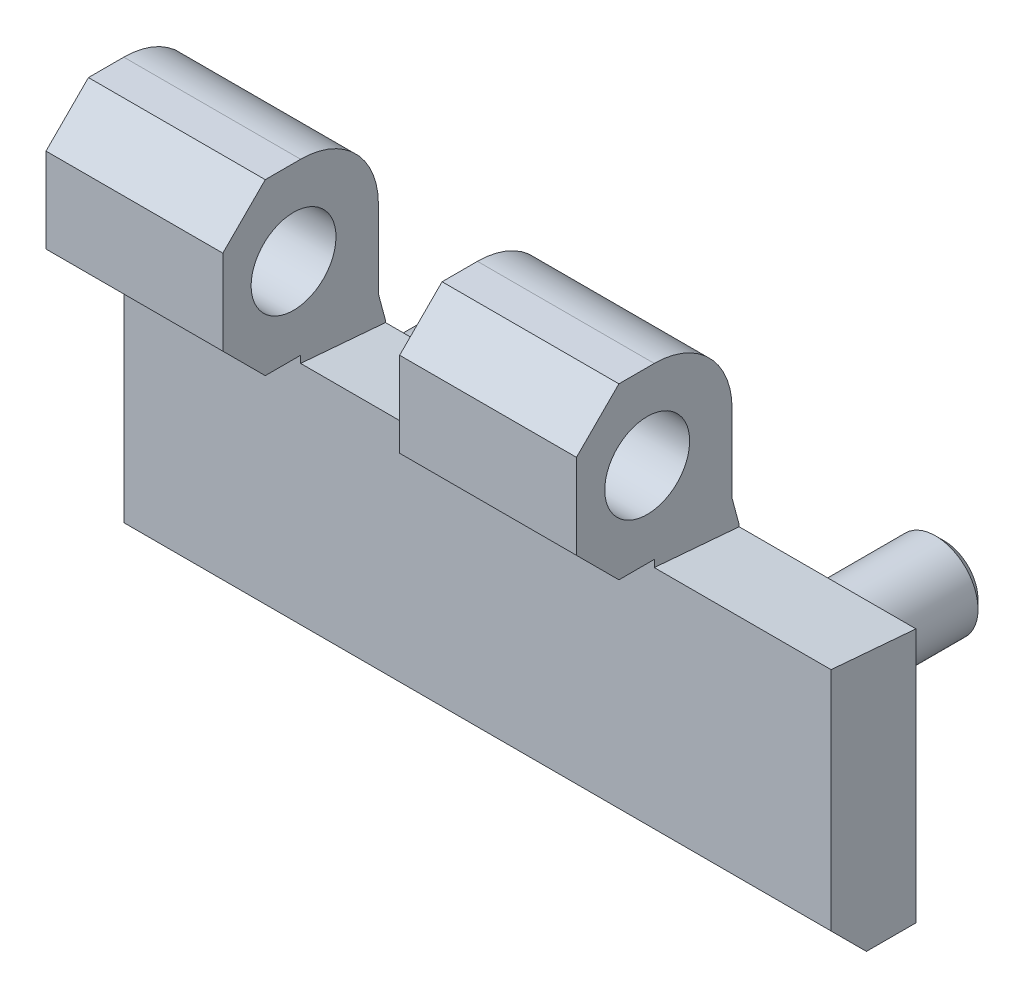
ISO-10303-21;
HEADER;
FILE_DESCRIPTION(('STEP AP214'),'2;1');
FILE_NAME('part.step','',(''),(''),'','','');
FILE_SCHEMA(('AUTOMOTIVE_DESIGN { 1 0 10303 214 1 1 1 1 }'));
ENDSEC;
DATA;
#1=APPLICATION_CONTEXT('core data for automotive mechanical design processes');
#2=APPLICATION_PROTOCOL_DEFINITION('international standard','automotive_design',2000,#1);
#3=PRODUCT_CONTEXT('',#1,'mechanical');
#4=PRODUCT('Part','Part','',(#3));
#5=PRODUCT_RELATED_PRODUCT_CATEGORY('part','',(#4));
#6=PRODUCT_DEFINITION_FORMATION('','',#4);
#7=PRODUCT_DEFINITION_CONTEXT('part definition',#1,'design');
#8=PRODUCT_DEFINITION('design','',#6,#7);
#9=PRODUCT_DEFINITION_SHAPE('','',#8);
#10=(LENGTH_UNIT() NAMED_UNIT(*) SI_UNIT(.MILLI.,.METRE.));
#11=(NAMED_UNIT(*) PLANE_ANGLE_UNIT() SI_UNIT($,.RADIAN.));
#12=(NAMED_UNIT(*) SI_UNIT($,.STERADIAN.) SOLID_ANGLE_UNIT());
#13=UNCERTAINTY_MEASURE_WITH_UNIT(LENGTH_MEASURE(1.E-05),#10,'distance_accuracy_value','');
#14=(GEOMETRIC_REPRESENTATION_CONTEXT(3) GLOBAL_UNCERTAINTY_ASSIGNED_CONTEXT((#13)) GLOBAL_UNIT_ASSIGNED_CONTEXT((#10,
#11,#12)) REPRESENTATION_CONTEXT('',''));
#15=CARTESIAN_POINT('',(0.,0.,0.));
#16=DIRECTION('',(0.,0.,1.));
#17=DIRECTION('',(1.,0.,0.));
#18=AXIS2_PLACEMENT_3D('',#15,#16,#17);
#19=CARTESIAN_POINT('',(-10.,8.,0.));
#20=DIRECTION('',(0.,0.99654575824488,-0.0830454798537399));
#21=DIRECTION('',(0.,0.0830454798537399,0.99654575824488));
#22=AXIS2_PLACEMENT_3D('',#19,#20,#21);
#23=PLANE('',#22);
#24=DIRECTION('',(0.,-0.0830454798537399,-0.99654575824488));
#25=VECTOR('',#24,1.);
#26=CARTESIAN_POINT('',(2.5,8.,0.));
#27=LINE('',#26,#25);
#28=CARTESIAN_POINT('',(2.5,8.5,6.));
#29=VERTEX_POINT('',#28);
#30=CARTESIAN_POINT('',(2.5,8.,0.));
#31=VERTEX_POINT('',#30);
#32=EDGE_CURVE('E29',#29,#31,#27,.T.);
#33=ORIENTED_EDGE('',*,*,#32,.F.);
#34=DIRECTION('',(1.,0.,0.));
#35=VECTOR('',#34,1.);
#36=CARTESIAN_POINT('',(-10.,8.5,6.));
#37=LINE('',#36,#35);
#38=CARTESIAN_POINT('',(15.,8.5,6.));
#39=VERTEX_POINT('',#38);
#40=EDGE_CURVE('E403',#29,#39,#37,.T.);
#41=ORIENTED_EDGE('',*,*,#40,.T.);
#42=DIRECTION('',(0.,-0.0830454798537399,-0.99654575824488));
#43=VECTOR('',#42,1.);
#44=CARTESIAN_POINT('',(15.,8.,0.));
#45=LINE('',#44,#43);
#46=CARTESIAN_POINT('',(15.,8.,0.));
#47=VERTEX_POINT('',#46);
#48=EDGE_CURVE('E369',#39,#47,#45,.T.);
#49=ORIENTED_EDGE('',*,*,#48,.T.);
#50=DIRECTION('',(1.,0.,0.));
#51=VECTOR('',#50,1.);
#52=CARTESIAN_POINT('',(-10.,8.,0.));
#53=LINE('',#52,#51);
#54=EDGE_CURVE('E36',#31,#47,#53,.T.);
#55=ORIENTED_EDGE('',*,*,#54,.F.);
#56=EDGE_LOOP('',(#33,#41,#49,#55));
#57=FACE_BOUND('',#56,.T.);
#58=ADVANCED_FACE('F14',(#57),#23,.T.);
#59=CARTESIAN_POINT('',(-10.,-10.,3.5));
#60=DIRECTION('',(0.,-1.,0.));
#61=DIRECTION('',(1.,0.,0.));
#62=AXIS2_PLACEMENT_3D('',#59,#60,#61);
#63=PLANE('',#62);
#64=DIRECTION('',(1.,0.,0.));
#65=VECTOR('',#64,1.);
#66=CARTESIAN_POINT('',(-10.,-10.,0.));
#67=LINE('',#66,#65);
#68=CARTESIAN_POINT('',(-10.,-10.,0.));
#69=VERTEX_POINT('',#68);
#70=CARTESIAN_POINT('',(40.,-10.,0.));
#71=VERTEX_POINT('',#70);
#72=EDGE_CURVE('E407',#69,#71,#67,.T.);
#73=ORIENTED_EDGE('',*,*,#72,.T.);
#74=DIRECTION('',(0.,0.,-1.));
#75=VECTOR('',#74,1.);
#76=CARTESIAN_POINT('',(40.,-10.,3.5));
#77=LINE('',#76,#75);
#78=CARTESIAN_POINT('',(40.,-10.,3.5));
#79=VERTEX_POINT('',#78);
#80=EDGE_CURVE('E374',#79,#71,#77,.T.);
#81=ORIENTED_EDGE('',*,*,#80,.F.);
#82=DIRECTION('',(1.,0.,0.));
#83=VECTOR('',#82,1.);
#84=CARTESIAN_POINT('',(-10.,-10.,3.5));
#85=LINE('',#84,#83);
#86=CARTESIAN_POINT('',(-10.,-10.,3.5));
#87=VERTEX_POINT('',#86);
#88=EDGE_CURVE('E396',#87,#79,#85,.T.);
#89=ORIENTED_EDGE('',*,*,#88,.F.);
#90=DIRECTION('',(0.,0.,-1.));
#91=VECTOR('',#90,1.);
#92=CARTESIAN_POINT('',(-10.,-10.,3.5));
#93=LINE('',#92,#91);
#94=EDGE_CURVE('E387',#87,#69,#93,.T.);
#95=ORIENTED_EDGE('',*,*,#94,.T.);
#96=EDGE_LOOP('',(#73,#81,#89,#95));
#97=FACE_BOUND('',#96,.T.);
#98=ADVANCED_FACE('F16',(#97),#63,.T.);
#99=CARTESIAN_POINT('',(-10.,-10.,0.));
#100=DIRECTION('',(0.,0.,-1.));
#101=DIRECTION('',(-1.,0.,0.));
#102=AXIS2_PLACEMENT_3D('',#99,#100,#101);
#103=PLANE('',#102);
#104=CARTESIAN_POINT('',(0.,0.,0.));
#105=DIRECTION('',(0.,0.,-1.));
#106=DIRECTION('',(-1.,0.,0.));
#107=AXIS2_PLACEMENT_3D('',#104,#105,#106);
#108=CIRCLE('',#107,3.);
#109=CARTESIAN_POINT('',(-3.,0.,0.));
#110=VERTEX_POINT('',#109);
#111=EDGE_CURVE('E9',#110,#110,#108,.T.);
#112=ORIENTED_EDGE('',*,*,#111,.F.);
#113=EDGE_LOOP('',(#112));
#114=FACE_BOUND('',#113,.T.);
#115=CARTESIAN_POINT('',(30.,0.,0.));
#116=DIRECTION('',(0.,0.,-1.));
#117=DIRECTION('',(-1.,0.,0.));
#118=AXIS2_PLACEMENT_3D('',#115,#116,#117);
#119=CIRCLE('',#118,3.);
#120=CARTESIAN_POINT('',(27.,0.,0.));
#121=VERTEX_POINT('',#120);
#122=EDGE_CURVE('E22',#121,#121,#119,.T.);
#123=ORIENTED_EDGE('',*,*,#122,.F.);
#124=EDGE_LOOP('',(#123));
#125=FACE_BOUND('',#124,.T.);
#126=DIRECTION('',(0.,1.,0.));
#127=VECTOR('',#126,1.);
#128=CARTESIAN_POINT('',(-10.,-10.,0.));
#129=LINE('',#128,#127);
#130=CARTESIAN_POINT('',(-10.,8.1339745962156,0.));
#131=VERTEX_POINT('',#130);
#132=EDGE_CURVE('E194',#69,#131,#129,.T.);
#133=ORIENTED_EDGE('',*,*,#132,.T.);
#134=DIRECTION('',(1.,0.,0.));
#135=VECTOR('',#134,1.);
#136=CARTESIAN_POINT('',(-10.,8.1339745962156,0.));
#137=LINE('',#136,#135);
#138=CARTESIAN_POINT('',(2.5,8.1339745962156,0.));
#139=VERTEX_POINT('',#138);
#140=EDGE_CURVE('E191',#131,#139,#137,.T.);
#141=ORIENTED_EDGE('',*,*,#140,.T.);
#142=DIRECTION('',(0.,1.,0.));
#143=VECTOR('',#142,1.);
#144=CARTESIAN_POINT('',(2.5,3.,0.));
#145=LINE('',#144,#143);
#146=EDGE_CURVE('E180',#31,#139,#145,.T.);
#147=ORIENTED_EDGE('',*,*,#146,.F.);
#148=ORIENTED_EDGE('',*,*,#54,.T.);
#149=DIRECTION('',(0.,1.,0.));
#150=VECTOR('',#149,1.);
#151=CARTESIAN_POINT('',(15.,3.,0.));
#152=LINE('',#151,#150);
#153=CARTESIAN_POINT('',(15.,8.1339745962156,0.));
#154=VERTEX_POINT('',#153);
#155=EDGE_CURVE('E284',#47,#154,#152,.T.);
#156=ORIENTED_EDGE('',*,*,#155,.T.);
#157=DIRECTION('',(-1.,0.,0.));
#158=VECTOR('',#157,1.);
#159=CARTESIAN_POINT('',(27.5,8.1339745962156,0.));
#160=LINE('',#159,#158);
#161=CARTESIAN_POINT('',(27.5,8.1339745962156,0.));
#162=VERTEX_POINT('',#161);
#163=EDGE_CURVE('E366',#162,#154,#160,.T.);
#164=ORIENTED_EDGE('',*,*,#163,.F.);
#165=DIRECTION('',(0.,1.,0.));
#166=VECTOR('',#165,1.);
#167=CARTESIAN_POINT('',(27.5,3.,0.));
#168=LINE('',#167,#166);
#169=CARTESIAN_POINT('',(27.5,8.,0.));
#170=VERTEX_POINT('',#169);
#171=EDGE_CURVE('E319',#170,#162,#168,.T.);
#172=ORIENTED_EDGE('',*,*,#171,.F.);
#173=CARTESIAN_POINT('',(40.,8.,0.));
#174=VERTEX_POINT('',#173);
#175=EDGE_CURVE('E405',#170,#174,#53,.T.);
#176=ORIENTED_EDGE('',*,*,#175,.T.);
#177=DIRECTION('',(0.,1.,0.));
#178=VECTOR('',#177,1.);
#179=CARTESIAN_POINT('',(40.,-10.,0.));
#180=LINE('',#179,#178);
#181=EDGE_CURVE('E375',#71,#174,#180,.T.);
#182=ORIENTED_EDGE('',*,*,#181,.F.);
#183=ORIENTED_EDGE('',*,*,#72,.F.);
#184=EDGE_LOOP('',(#133,#141,#147,#148,#156,#164,#172,#176,#182,#183));
#185=FACE_BOUND('',#184,.T.);
#186=ADVANCED_FACE('F192',(#114,#125,#185),#103,.T.);
#187=DIRECTION('',(0.,-0.0830454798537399,-0.99654575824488));
#188=VECTOR('',#187,1.);
#189=CARTESIAN_POINT('',(27.5,8.,0.));
#190=LINE('',#189,#188);
#191=CARTESIAN_POINT('',(27.5,8.5,6.));
#192=VERTEX_POINT('',#191);
#193=EDGE_CURVE('E372',#192,#170,#190,.T.);
#194=ORIENTED_EDGE('',*,*,#193,.F.);
#195=CARTESIAN_POINT('',(40.,8.5,6.));
#196=VERTEX_POINT('',#195);
#197=EDGE_CURVE('E402',#192,#196,#37,.T.);
#198=ORIENTED_EDGE('',*,*,#197,.T.);
#199=DIRECTION('',(0.,0.0830454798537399,0.99654575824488));
#200=VECTOR('',#199,1.);
#201=CARTESIAN_POINT('',(40.,8.,0.));
#202=LINE('',#201,#200);
#203=EDGE_CURVE('E378',#174,#196,#202,.T.);
#204=ORIENTED_EDGE('',*,*,#203,.F.);
#205=ORIENTED_EDGE('',*,*,#175,.F.);
#206=EDGE_LOOP('',(#194,#198,#204,#205));
#207=FACE_BOUND('',#206,.T.);
#208=ADVANCED_FACE('F414',(#207),#23,.T.);
#209=CARTESIAN_POINT('',(-10.,8.5,6.));
#210=DIRECTION('',(0.,0.,1.));
#211=DIRECTION('',(1.,0.,0.));
#212=AXIS2_PLACEMENT_3D('',#209,#210,#211);
#213=PLANE('',#212);
#214=DIRECTION('',(0.,-1.,0.));
#215=VECTOR('',#214,1.);
#216=CARTESIAN_POINT('',(-10.,8.5,6.));
#217=LINE('',#216,#215);
#218=CARTESIAN_POINT('',(-10.,9.,6.));
#219=VERTEX_POINT('',#218);
#220=CARTESIAN_POINT('',(-10.,-7.5,6.));
#221=VERTEX_POINT('',#220);
#222=EDGE_CURVE('E391',#219,#221,#217,.T.);
#223=ORIENTED_EDGE('',*,*,#222,.T.);
#224=DIRECTION('',(1.,0.,0.));
#225=VECTOR('',#224,1.);
#226=CARTESIAN_POINT('',(-10.,-7.5,6.));
#227=LINE('',#226,#225);
#228=CARTESIAN_POINT('',(40.,-7.5,6.));
#229=VERTEX_POINT('',#228);
#230=EDGE_CURVE('E400',#221,#229,#227,.T.);
#231=ORIENTED_EDGE('',*,*,#230,.T.);
#232=DIRECTION('',(0.,-1.,0.));
#233=VECTOR('',#232,1.);
#234=CARTESIAN_POINT('',(40.,8.5,6.));
#235=LINE('',#234,#233);
#236=EDGE_CURVE('E381',#196,#229,#235,.T.);
#237=ORIENTED_EDGE('',*,*,#236,.F.);
#238=ORIENTED_EDGE('',*,*,#197,.F.);
#239=DIRECTION('',(0.,-1.,0.));
#240=VECTOR('',#239,1.);
#241=CARTESIAN_POINT('',(27.5,9.,6.));
#242=LINE('',#241,#240);
#243=CARTESIAN_POINT('',(27.5,9.,6.));
#244=VERTEX_POINT('',#243);
#245=EDGE_CURVE('E337',#244,#192,#242,.T.);
#246=ORIENTED_EDGE('',*,*,#245,.F.);
#247=DIRECTION('',(-1.,0.,0.));
#248=VECTOR('',#247,1.);
#249=CARTESIAN_POINT('',(27.5,9.,6.));
#250=LINE('',#249,#248);
#251=CARTESIAN_POINT('',(15.,9.,6.));
#252=VERTEX_POINT('',#251);
#253=EDGE_CURVE('E342',#244,#252,#250,.T.);
#254=ORIENTED_EDGE('',*,*,#253,.T.);
#255=DIRECTION('',(0.,-1.,0.));
#256=VECTOR('',#255,1.);
#257=CARTESIAN_POINT('',(15.,9.,6.));
#258=LINE('',#257,#256);
#259=EDGE_CURVE('E311',#252,#39,#258,.T.);
#260=ORIENTED_EDGE('',*,*,#259,.T.);
#261=ORIENTED_EDGE('',*,*,#40,.F.);
#262=DIRECTION('',(0.,-1.,0.));
#263=VECTOR('',#262,1.);
#264=CARTESIAN_POINT('',(2.5,9.,6.));
#265=LINE('',#264,#263);
#266=CARTESIAN_POINT('',(2.5,9.,6.));
#267=VERTEX_POINT('',#266);
#268=EDGE_CURVE('E235',#267,#29,#265,.T.);
#269=ORIENTED_EDGE('',*,*,#268,.F.);
#270=DIRECTION('',(1.,0.,0.));
#271=VECTOR('',#270,1.);
#272=CARTESIAN_POINT('',(-10.,9.,6.));
#273=LINE('',#272,#271);
#274=EDGE_CURVE('E268',#219,#267,#273,.T.);
#275=ORIENTED_EDGE('',*,*,#274,.F.);
#276=EDGE_LOOP('',(#223,#231,#237,#238,#246,#254,#260,#261,#269,#275));
#277=FACE_BOUND('',#276,.T.);
#278=ADVANCED_FACE('F422',(#277),#213,.T.);
#279=CARTESIAN_POINT('',(-10.,-7.5,6.));
#280=DIRECTION('',(0.,-0.707106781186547,0.707106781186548));
#281=DIRECTION('',(0.,-0.707106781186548,-0.707106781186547));
#282=AXIS2_PLACEMENT_3D('',#279,#280,#281);
#283=PLANE('',#282);
#284=ORIENTED_EDGE('',*,*,#88,.T.);
#285=DIRECTION('',(0.,-0.707106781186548,-0.707106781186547));
#286=VECTOR('',#285,1.);
#287=CARTESIAN_POINT('',(40.,-7.5,6.));
#288=LINE('',#287,#286);
#289=EDGE_CURVE('E384',#229,#79,#288,.T.);
#290=ORIENTED_EDGE('',*,*,#289,.F.);
#291=ORIENTED_EDGE('',*,*,#230,.F.);
#292=DIRECTION('',(0.,-0.707106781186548,-0.707106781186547));
#293=VECTOR('',#292,1.);
#294=CARTESIAN_POINT('',(-10.,-7.5,6.));
#295=LINE('',#294,#293);
#296=EDGE_CURVE('E393',#221,#87,#295,.T.);
#297=ORIENTED_EDGE('',*,*,#296,.T.);
#298=EDGE_LOOP('',(#284,#290,#291,#297));
#299=FACE_BOUND('',#298,.T.);
#300=ADVANCED_FACE('F434',(#299),#283,.T.);
#301=CARTESIAN_POINT('',(-10.,-10.,0.));
#302=DIRECTION('',(1.,0.,0.));
#303=DIRECTION('',(0.,1.,0.));
#304=AXIS2_PLACEMENT_3D('',#301,#302,#303);
#305=PLANE('',#304);
#306=ORIENTED_EDGE('',*,*,#296,.F.);
#307=ORIENTED_EDGE('',*,*,#222,.F.);
#308=DIRECTION('',(0.,0.,-1.));
#309=VECTOR('',#308,1.);
#310=CARTESIAN_POINT('',(-10.,9.,8.5));
#311=LINE('',#310,#309);
#312=CARTESIAN_POINT('',(-10.,9.,8.5));
#313=VERTEX_POINT('',#312);
#314=EDGE_CURVE('E262',#313,#219,#311,.T.);
#315=ORIENTED_EDGE('',*,*,#314,.F.);
#316=DIRECTION('',(0.,-0.707106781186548,-0.707106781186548));
#317=VECTOR('',#316,1.);
#318=CARTESIAN_POINT('',(-10.,12.,11.5));
#319=LINE('',#318,#317);
#320=CARTESIAN_POINT('',(-10.,12.,11.5));
#321=VERTEX_POINT('',#320);
#322=EDGE_CURVE('E259',#321,#313,#319,.T.);
#323=ORIENTED_EDGE('',*,*,#322,.F.);
#324=DIRECTION('',(0.,-1.,0.));
#325=VECTOR('',#324,1.);
#326=CARTESIAN_POINT('',(-10.,18.,11.5));
#327=LINE('',#326,#325);
#328=CARTESIAN_POINT('',(-10.,18.,11.5));
#329=VERTEX_POINT('',#328);
#330=EDGE_CURVE('E256',#329,#321,#327,.T.);
#331=ORIENTED_EDGE('',*,*,#330,.F.);
#332=DIRECTION('',(0.,-0.707106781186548,0.707106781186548));
#333=VECTOR('',#332,1.);
#334=CARTESIAN_POINT('',(-10.,21.,8.5));
#335=LINE('',#334,#333);
#336=CARTESIAN_POINT('',(-10.,21.,8.5));
#337=VERTEX_POINT('',#336);
#338=EDGE_CURVE('E253',#337,#329,#335,.T.);
#339=ORIENTED_EDGE('',*,*,#338,.F.);
#340=DIRECTION('',(0.,0.,1.));
#341=VECTOR('',#340,1.);
#342=CARTESIAN_POINT('',(-10.,21.,6.));
#343=LINE('',#342,#341);
#344=CARTESIAN_POINT('',(-10.,21.,6.));
#345=VERTEX_POINT('',#344);
#346=EDGE_CURVE('E250',#345,#337,#343,.T.);
#347=ORIENTED_EDGE('',*,*,#346,.F.);
#348=CARTESIAN_POINT('',(-10.,15.5,6.));
#349=DIRECTION('',(1.,0.,0.));
#350=DIRECTION('',(0.,-1.,0.));
#351=AXIS2_PLACEMENT_3D('',#348,#349,#350);
#352=CIRCLE('',#351,5.5);
#353=CARTESIAN_POINT('',(-10.,15.5,0.5));
#354=VERTEX_POINT('',#353);
#355=EDGE_CURVE('E247',#354,#345,#352,.T.);
#356=ORIENTED_EDGE('',*,*,#355,.F.);
#357=DIRECTION('',(0.,1.,0.));
#358=VECTOR('',#357,1.);
#359=CARTESIAN_POINT('',(-10.,10.,0.5));
#360=LINE('',#359,#358);
#361=CARTESIAN_POINT('',(-10.,10.,0.5));
#362=VERTEX_POINT('',#361);
#363=EDGE_CURVE('E244',#362,#354,#360,.T.);
#364=ORIENTED_EDGE('',*,*,#363,.F.);
#365=DIRECTION('',(0.,0.965925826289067,0.258819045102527));
#366=VECTOR('',#365,1.);
#367=CARTESIAN_POINT('',(-10.,8.1339745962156,0.));
#368=LINE('',#367,#366);
#369=EDGE_CURVE('E242',#131,#362,#368,.T.);
#370=ORIENTED_EDGE('',*,*,#369,.F.);
#371=ORIENTED_EDGE('',*,*,#132,.F.);
#372=ORIENTED_EDGE('',*,*,#94,.F.);
#373=EDGE_LOOP('',(#306,#307,#315,#323,#331,#339,#347,#356,#364,#370,#371,#372));
#374=FACE_BOUND('',#373,.T.);
#375=CARTESIAN_POINT('',(-10.,15.,6.5));
#376=DIRECTION('',(1.,0.,0.));
#377=DIRECTION('',(0.,1.,0.));
#378=AXIS2_PLACEMENT_3D('',#375,#376,#377);
#379=CIRCLE('',#378,3.);
#380=CARTESIAN_POINT('',(-10.,18.,6.5));
#381=VERTEX_POINT('',#380);
#382=EDGE_CURVE('E265',#381,#381,#379,.T.);
#383=ORIENTED_EDGE('',*,*,#382,.T.);
#384=EDGE_LOOP('',(#383));
#385=FACE_BOUND('',#384,.T.);
#386=ADVANCED_FACE('F438',(#374,#385),#305,.F.);
#387=CARTESIAN_POINT('',(40.,-10.,0.));
#388=DIRECTION('',(1.,0.,0.));
#389=DIRECTION('',(0.,1.,0.));
#390=AXIS2_PLACEMENT_3D('',#387,#388,#389);
#391=PLANE('',#390);
#392=ORIENTED_EDGE('',*,*,#80,.T.);
#393=ORIENTED_EDGE('',*,*,#181,.T.);
#394=ORIENTED_EDGE('',*,*,#203,.T.);
#395=ORIENTED_EDGE('',*,*,#236,.T.);
#396=ORIENTED_EDGE('',*,*,#289,.T.);
#397=EDGE_LOOP('',(#392,#393,#394,#395,#396));
#398=FACE_BOUND('',#397,.T.);
#399=ADVANCED_FACE('F442',(#398),#391,.T.);
#400=CARTESIAN_POINT('',(27.5,8.1339745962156,0.));
#401=DIRECTION('',(0.,-0.258819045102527,0.965925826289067));
#402=DIRECTION('',(0.,-0.965925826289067,-0.258819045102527));
#403=AXIS2_PLACEMENT_3D('',#400,#401,#402);
#404=PLANE('',#403);
#405=DIRECTION('',(0.,0.965925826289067,0.258819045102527));
#406=VECTOR('',#405,1.);
#407=CARTESIAN_POINT('',(15.,8.1339745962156,0.));
#408=LINE('',#407,#406);
#409=CARTESIAN_POINT('',(15.,10.,0.5));
#410=VERTEX_POINT('',#409);
#411=EDGE_CURVE('E287',#154,#410,#408,.T.);
#412=ORIENTED_EDGE('',*,*,#411,.T.);
#413=DIRECTION('',(-1.,0.,0.));
#414=VECTOR('',#413,1.);
#415=CARTESIAN_POINT('',(27.5,10.,0.5));
#416=LINE('',#415,#414);
#417=CARTESIAN_POINT('',(27.5,10.,0.5));
#418=VERTEX_POINT('',#417);
#419=EDGE_CURVE('E363',#418,#410,#416,.T.);
#420=ORIENTED_EDGE('',*,*,#419,.F.);
#421=DIRECTION('',(0.,0.965925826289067,0.258819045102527));
#422=VECTOR('',#421,1.);
#423=CARTESIAN_POINT('',(27.5,8.1339745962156,0.));
#424=LINE('',#423,#422);
#425=EDGE_CURVE('E321',#162,#418,#424,.T.);
#426=ORIENTED_EDGE('',*,*,#425,.F.);
#427=ORIENTED_EDGE('',*,*,#163,.T.);
#428=EDGE_LOOP('',(#412,#420,#426,#427));
#429=FACE_BOUND('',#428,.T.);
#430=ADVANCED_FACE('F446',(#429),#404,.F.);
#431=CARTESIAN_POINT('',(27.5,10.,0.5));
#432=DIRECTION('',(0.,0.,1.));
#433=DIRECTION('',(1.,0.,0.));
#434=AXIS2_PLACEMENT_3D('',#431,#432,#433);
#435=PLANE('',#434);
#436=DIRECTION('',(0.,1.,0.));
#437=VECTOR('',#436,1.);
#438=CARTESIAN_POINT('',(15.,10.,0.5));
#439=LINE('',#438,#437);
#440=CARTESIAN_POINT('',(15.,15.5,0.5));
#441=VERTEX_POINT('',#440);
#442=EDGE_CURVE('E290',#410,#441,#439,.T.);
#443=ORIENTED_EDGE('',*,*,#442,.T.);
#444=DIRECTION('',(-1.,0.,0.));
#445=VECTOR('',#444,1.);
#446=CARTESIAN_POINT('',(27.5,15.5,0.5));
#447=LINE('',#446,#445);
#448=CARTESIAN_POINT('',(27.5,15.5,0.5));
#449=VERTEX_POINT('',#448);
#450=EDGE_CURVE('E360',#449,#441,#447,.T.);
#451=ORIENTED_EDGE('',*,*,#450,.F.);
#452=DIRECTION('',(0.,1.,0.));
#453=VECTOR('',#452,1.);
#454=CARTESIAN_POINT('',(27.5,10.,0.5));
#455=LINE('',#454,#453);
#456=EDGE_CURVE('E323',#418,#449,#455,.T.);
#457=ORIENTED_EDGE('',*,*,#456,.F.);
#458=ORIENTED_EDGE('',*,*,#419,.T.);
#459=EDGE_LOOP('',(#443,#451,#457,#458));
#460=FACE_BOUND('',#459,.T.);
#461=ADVANCED_FACE('F450',(#460),#435,.F.);
#462=CARTESIAN_POINT('',(27.5,15.5,6.));
#463=DIRECTION('',(-1.,0.,0.));
#464=DIRECTION('',(0.,-1.,0.));
#465=AXIS2_PLACEMENT_3D('',#462,#463,#464);
#466=CYLINDRICAL_SURFACE('',#465,5.5);
#467=CARTESIAN_POINT('',(15.,15.5,6.));
#468=DIRECTION('',(1.,0.,0.));
#469=DIRECTION('',(0.,-1.,0.));
#470=AXIS2_PLACEMENT_3D('',#467,#468,#469);
#471=CIRCLE('',#470,5.5);
#472=CARTESIAN_POINT('',(15.,21.,6.));
#473=VERTEX_POINT('',#472);
#474=EDGE_CURVE('E293',#441,#473,#471,.T.);
#475=ORIENTED_EDGE('',*,*,#474,.T.);
#476=DIRECTION('',(-1.,0.,0.));
#477=VECTOR('',#476,1.);
#478=CARTESIAN_POINT('',(27.5,21.,6.));
#479=LINE('',#478,#477);
#480=CARTESIAN_POINT('',(27.5,21.,6.));
#481=VERTEX_POINT('',#480);
#482=EDGE_CURVE('E357',#481,#473,#479,.T.);
#483=ORIENTED_EDGE('',*,*,#482,.F.);
#484=CARTESIAN_POINT('',(27.5,15.5,6.));
#485=DIRECTION('',(1.,0.,0.));
#486=DIRECTION('',(0.,-1.,0.));
#487=AXIS2_PLACEMENT_3D('',#484,#485,#486);
#488=CIRCLE('',#487,5.5);
#489=EDGE_CURVE('E325',#449,#481,#488,.T.);
#490=ORIENTED_EDGE('',*,*,#489,.F.);
#491=ORIENTED_EDGE('',*,*,#450,.T.);
#492=EDGE_LOOP('',(#475,#483,#490,#491));
#493=FACE_BOUND('',#492,.T.);
#494=ADVANCED_FACE('F454',(#493),#466,.T.);
#495=CARTESIAN_POINT('',(27.5,21.,6.));
#496=DIRECTION('',(0.,-1.,0.));
#497=DIRECTION('',(1.,0.,0.));
#498=AXIS2_PLACEMENT_3D('',#495,#496,#497);
#499=PLANE('',#498);
#500=DIRECTION('',(0.,0.,1.));
#501=VECTOR('',#500,1.);
#502=CARTESIAN_POINT('',(15.,21.,6.));
#503=LINE('',#502,#501);
#504=CARTESIAN_POINT('',(15.,21.,8.5));
#505=VERTEX_POINT('',#504);
#506=EDGE_CURVE('E296',#473,#505,#503,.T.);
#507=ORIENTED_EDGE('',*,*,#506,.T.);
#508=DIRECTION('',(-1.,0.,0.));
#509=VECTOR('',#508,1.);
#510=CARTESIAN_POINT('',(27.5,21.,8.5));
#511=LINE('',#510,#509);
#512=CARTESIAN_POINT('',(27.5,21.,8.5));
#513=VERTEX_POINT('',#512);
#514=EDGE_CURVE('E354',#513,#505,#511,.T.);
#515=ORIENTED_EDGE('',*,*,#514,.F.);
#516=DIRECTION('',(0.,0.,1.));
#517=VECTOR('',#516,1.);
#518=CARTESIAN_POINT('',(27.5,21.,6.));
#519=LINE('',#518,#517);
#520=EDGE_CURVE('E327',#481,#513,#519,.T.);
#521=ORIENTED_EDGE('',*,*,#520,.F.);
#522=ORIENTED_EDGE('',*,*,#482,.T.);
#523=EDGE_LOOP('',(#507,#515,#521,#522));
#524=FACE_BOUND('',#523,.T.);
#525=ADVANCED_FACE('F458',(#524),#499,.F.);
#526=CARTESIAN_POINT('',(27.5,21.,8.5));
#527=DIRECTION('',(0.,-0.707106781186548,-0.707106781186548));
#528=DIRECTION('',(0.,0.707106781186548,-0.707106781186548));
#529=AXIS2_PLACEMENT_3D('',#526,#527,#528);
#530=PLANE('',#529);
#531=DIRECTION('',(0.,-0.707106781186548,0.707106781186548));
#532=VECTOR('',#531,1.);
#533=CARTESIAN_POINT('',(15.,21.,8.5));
#534=LINE('',#533,#532);
#535=CARTESIAN_POINT('',(15.,18.,11.5));
#536=VERTEX_POINT('',#535);
#537=EDGE_CURVE('E299',#505,#536,#534,.T.);
#538=ORIENTED_EDGE('',*,*,#537,.T.);
#539=DIRECTION('',(-1.,0.,0.));
#540=VECTOR('',#539,1.);
#541=CARTESIAN_POINT('',(27.5,18.,11.5));
#542=LINE('',#541,#540);
#543=CARTESIAN_POINT('',(27.5,18.,11.5));
#544=VERTEX_POINT('',#543);
#545=EDGE_CURVE('E351',#544,#536,#542,.T.);
#546=ORIENTED_EDGE('',*,*,#545,.F.);
#547=DIRECTION('',(0.,-0.707106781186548,0.707106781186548));
#548=VECTOR('',#547,1.);
#549=CARTESIAN_POINT('',(27.5,21.,8.5));
#550=LINE('',#549,#548);
#551=EDGE_CURVE('E329',#513,#544,#550,.T.);
#552=ORIENTED_EDGE('',*,*,#551,.F.);
#553=ORIENTED_EDGE('',*,*,#514,.T.);
#554=EDGE_LOOP('',(#538,#546,#552,#553));
#555=FACE_BOUND('',#554,.T.);
#556=ADVANCED_FACE('F462',(#555),#530,.F.);
#557=CARTESIAN_POINT('',(27.5,18.,11.5));
#558=DIRECTION('',(0.,0.,-1.));
#559=DIRECTION('',(-1.,0.,0.));
#560=AXIS2_PLACEMENT_3D('',#557,#558,#559);
#561=PLANE('',#560);
#562=DIRECTION('',(0.,-1.,0.));
#563=VECTOR('',#562,1.);
#564=CARTESIAN_POINT('',(15.,18.,11.5));
#565=LINE('',#564,#563);
#566=CARTESIAN_POINT('',(15.,12.,11.5));
#567=VERTEX_POINT('',#566);
#568=EDGE_CURVE('E302',#536,#567,#565,.T.);
#569=ORIENTED_EDGE('',*,*,#568,.T.);
#570=DIRECTION('',(-1.,0.,0.));
#571=VECTOR('',#570,1.);
#572=CARTESIAN_POINT('',(27.5,12.,11.5));
#573=LINE('',#572,#571);
#574=CARTESIAN_POINT('',(27.5,12.,11.5));
#575=VERTEX_POINT('',#574);
#576=EDGE_CURVE('E348',#575,#567,#573,.T.);
#577=ORIENTED_EDGE('',*,*,#576,.F.);
#578=DIRECTION('',(0.,-1.,0.));
#579=VECTOR('',#578,1.);
#580=CARTESIAN_POINT('',(27.5,18.,11.5));
#581=LINE('',#580,#579);
#582=EDGE_CURVE('E331',#544,#575,#581,.T.);
#583=ORIENTED_EDGE('',*,*,#582,.F.);
#584=ORIENTED_EDGE('',*,*,#545,.T.);
#585=EDGE_LOOP('',(#569,#577,#583,#584));
#586=FACE_BOUND('',#585,.T.);
#587=ADVANCED_FACE('F466',(#586),#561,.F.);
#588=CARTESIAN_POINT('',(27.5,12.,11.5));
#589=DIRECTION('',(0.,0.707106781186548,-0.707106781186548));
#590=DIRECTION('',(0.,0.707106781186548,0.707106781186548));
#591=AXIS2_PLACEMENT_3D('',#588,#589,#590);
#592=PLANE('',#591);
#593=DIRECTION('',(0.,-0.707106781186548,-0.707106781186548));
#594=VECTOR('',#593,1.);
#595=CARTESIAN_POINT('',(15.,12.,11.5));
#596=LINE('',#595,#594);
#597=CARTESIAN_POINT('',(15.,9.,8.5));
#598=VERTEX_POINT('',#597);
#599=EDGE_CURVE('E305',#567,#598,#596,.T.);
#600=ORIENTED_EDGE('',*,*,#599,.T.);
#601=DIRECTION('',(-1.,0.,0.));
#602=VECTOR('',#601,1.);
#603=CARTESIAN_POINT('',(27.5,9.,8.5));
#604=LINE('',#603,#602);
#605=CARTESIAN_POINT('',(27.5,9.,8.5));
#606=VERTEX_POINT('',#605);
#607=EDGE_CURVE('E345',#606,#598,#604,.T.);
#608=ORIENTED_EDGE('',*,*,#607,.F.);
#609=DIRECTION('',(0.,-0.707106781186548,-0.707106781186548));
#610=VECTOR('',#609,1.);
#611=CARTESIAN_POINT('',(27.5,12.,11.5));
#612=LINE('',#611,#610);
#613=EDGE_CURVE('E333',#575,#606,#612,.T.);
#614=ORIENTED_EDGE('',*,*,#613,.F.);
#615=ORIENTED_EDGE('',*,*,#576,.T.);
#616=EDGE_LOOP('',(#600,#608,#614,#615));
#617=FACE_BOUND('',#616,.T.);
#618=ADVANCED_FACE('F470',(#617),#592,.F.);
#619=CARTESIAN_POINT('',(27.5,9.,8.5));
#620=DIRECTION('',(0.,1.,0.));
#621=DIRECTION('',(-1.,0.,0.));
#622=AXIS2_PLACEMENT_3D('',#619,#620,#621);
#623=PLANE('',#622);
#624=DIRECTION('',(0.,0.,-1.));
#625=VECTOR('',#624,1.);
#626=CARTESIAN_POINT('',(15.,9.,8.5));
#627=LINE('',#626,#625);
#628=EDGE_CURVE('E308',#598,#252,#627,.T.);
#629=ORIENTED_EDGE('',*,*,#628,.T.);
#630=ORIENTED_EDGE('',*,*,#253,.F.);
#631=DIRECTION('',(0.,0.,-1.));
#632=VECTOR('',#631,1.);
#633=CARTESIAN_POINT('',(27.5,9.,8.5));
#634=LINE('',#633,#632);
#635=EDGE_CURVE('E335',#606,#244,#634,.T.);
#636=ORIENTED_EDGE('',*,*,#635,.F.);
#637=ORIENTED_EDGE('',*,*,#607,.T.);
#638=EDGE_LOOP('',(#629,#630,#636,#637));
#639=FACE_BOUND('',#638,.T.);
#640=ADVANCED_FACE('F474',(#639),#623,.F.);
#641=CARTESIAN_POINT('',(27.5,15.,6.5));
#642=DIRECTION('',(-1.,0.,0.));
#643=DIRECTION('',(0.,-1.,0.));
#644=AXIS2_PLACEMENT_3D('',#641,#642,#643);
#645=CYLINDRICAL_SURFACE('',#644,3.);
#646=CARTESIAN_POINT('',(27.5,15.,6.5));
#647=DIRECTION('',(1.,0.,0.));
#648=DIRECTION('',(0.,1.,0.));
#649=AXIS2_PLACEMENT_3D('',#646,#647,#648);
#650=CIRCLE('',#649,3.);
#651=CARTESIAN_POINT('',(27.5,18.,6.5));
#652=VERTEX_POINT('',#651);
#653=EDGE_CURVE('E339',#652,#652,#650,.T.);
#654=ORIENTED_EDGE('',*,*,#653,.T.);
#655=EDGE_LOOP('',(#654));
#656=FACE_BOUND('',#655,.T.);
#657=CARTESIAN_POINT('',(15.,15.,6.5));
#658=DIRECTION('',(1.,0.,0.));
#659=DIRECTION('',(0.,1.,0.));
#660=AXIS2_PLACEMENT_3D('',#657,#658,#659);
#661=CIRCLE('',#660,3.);
#662=CARTESIAN_POINT('',(15.,18.,6.5));
#663=VERTEX_POINT('',#662);
#664=EDGE_CURVE('E315',#663,#663,#661,.T.);
#665=ORIENTED_EDGE('',*,*,#664,.F.);
#666=EDGE_LOOP('',(#665));
#667=FACE_BOUND('',#666,.T.);
#668=ADVANCED_FACE('F478',(#656,#667),#645,.F.);
#669=CARTESIAN_POINT('',(27.5,15.5,6.));
#670=DIRECTION('',(1.,0.,0.));
#671=DIRECTION('',(0.,1.,0.));
#672=AXIS2_PLACEMENT_3D('',#669,#670,#671);
#673=PLANE('',#672);
#674=ORIENTED_EDGE('',*,*,#653,.F.);
#675=EDGE_LOOP('',(#674));
#676=FACE_BOUND('',#675,.T.);
#677=ORIENTED_EDGE('',*,*,#245,.T.);
#678=ORIENTED_EDGE('',*,*,#193,.T.);
#679=ORIENTED_EDGE('',*,*,#171,.T.);
#680=ORIENTED_EDGE('',*,*,#425,.T.);
#681=ORIENTED_EDGE('',*,*,#456,.T.);
#682=ORIENTED_EDGE('',*,*,#489,.T.);
#683=ORIENTED_EDGE('',*,*,#520,.T.);
#684=ORIENTED_EDGE('',*,*,#551,.T.);
#685=ORIENTED_EDGE('',*,*,#582,.T.);
#686=ORIENTED_EDGE('',*,*,#613,.T.);
#687=ORIENTED_EDGE('',*,*,#635,.T.);
#688=EDGE_LOOP('',(#677,#678,#679,#680,#681,#682,#683,#684,#685,#686,#687));
#689=FACE_BOUND('',#688,.T.);
#690=ADVANCED_FACE('F482',(#676,#689),#673,.T.);
#691=CARTESIAN_POINT('',(15.,15.5,6.));
#692=DIRECTION('',(1.,0.,0.));
#693=DIRECTION('',(0.,1.,0.));
#694=AXIS2_PLACEMENT_3D('',#691,#692,#693);
#695=PLANE('',#694);
#696=ORIENTED_EDGE('',*,*,#48,.F.);
#697=ORIENTED_EDGE('',*,*,#259,.F.);
#698=ORIENTED_EDGE('',*,*,#628,.F.);
#699=ORIENTED_EDGE('',*,*,#599,.F.);
#700=ORIENTED_EDGE('',*,*,#568,.F.);
#701=ORIENTED_EDGE('',*,*,#537,.F.);
#702=ORIENTED_EDGE('',*,*,#506,.F.);
#703=ORIENTED_EDGE('',*,*,#474,.F.);
#704=ORIENTED_EDGE('',*,*,#442,.F.);
#705=ORIENTED_EDGE('',*,*,#411,.F.);
#706=ORIENTED_EDGE('',*,*,#155,.F.);
#707=EDGE_LOOP('',(#696,#697,#698,#699,#700,#701,#702,#703,#704,#705,#706));
#708=FACE_BOUND('',#707,.T.);
#709=ORIENTED_EDGE('',*,*,#664,.T.);
#710=EDGE_LOOP('',(#709));
#711=FACE_BOUND('',#710,.T.);
#712=ADVANCED_FACE('F486',(#708,#711),#695,.F.);
#713=CARTESIAN_POINT('',(-10.,8.1339745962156,0.));
#714=DIRECTION('',(0.,0.258819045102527,-0.965925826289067));
#715=DIRECTION('',(0.,0.965925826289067,0.258819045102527));
#716=AXIS2_PLACEMENT_3D('',#713,#714,#715);
#717=PLANE('',#716);
#718=DIRECTION('',(0.,0.965925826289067,0.258819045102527));
#719=VECTOR('',#718,1.);
#720=CARTESIAN_POINT('',(2.5,8.1339745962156,0.));
#721=LINE('',#720,#719);
#722=CARTESIAN_POINT('',(2.5,10.,0.5));
#723=VERTEX_POINT('',#722);
#724=EDGE_CURVE('E186',#139,#723,#721,.T.);
#725=ORIENTED_EDGE('',*,*,#724,.F.);
#726=ORIENTED_EDGE('',*,*,#140,.F.);
#727=ORIENTED_EDGE('',*,*,#369,.T.);
#728=DIRECTION('',(1.,0.,0.));
#729=VECTOR('',#728,1.);
#730=CARTESIAN_POINT('',(-10.,10.,0.5));
#731=LINE('',#730,#729);
#732=EDGE_CURVE('E198',#362,#723,#731,.T.);
#733=ORIENTED_EDGE('',*,*,#732,.T.);
#734=EDGE_LOOP('',(#725,#726,#727,#733));
#735=FACE_BOUND('',#734,.T.);
#736=ADVANCED_FACE('F200',(#735),#717,.T.);
#737=CARTESIAN_POINT('',(-10.,10.,0.5));
#738=DIRECTION('',(0.,0.,-1.));
#739=DIRECTION('',(-1.,0.,0.));
#740=AXIS2_PLACEMENT_3D('',#737,#738,#739);
#741=PLANE('',#740);
#742=DIRECTION('',(0.,1.,0.));
#743=VECTOR('',#742,1.);
#744=CARTESIAN_POINT('',(2.5,10.,0.5));
#745=LINE('',#744,#743);
#746=CARTESIAN_POINT('',(2.5,15.5,0.5));
#747=VERTEX_POINT('',#746);
#748=EDGE_CURVE('E203',#723,#747,#745,.T.);
#749=ORIENTED_EDGE('',*,*,#748,.F.);
#750=ORIENTED_EDGE('',*,*,#732,.F.);
#751=ORIENTED_EDGE('',*,*,#363,.T.);
#752=DIRECTION('',(1.,0.,0.));
#753=VECTOR('',#752,1.);
#754=CARTESIAN_POINT('',(-10.,15.5,0.5));
#755=LINE('',#754,#753);
#756=EDGE_CURVE('E280',#354,#747,#755,.T.);
#757=ORIENTED_EDGE('',*,*,#756,.T.);
#758=EDGE_LOOP('',(#749,#750,#751,#757));
#759=FACE_BOUND('',#758,.T.);
#760=ADVANCED_FACE('F493',(#759),#741,.T.);
#761=CARTESIAN_POINT('',(-10.,15.5,6.));
#762=DIRECTION('',(1.,0.,0.));
#763=DIRECTION('',(0.,1.,0.));
#764=AXIS2_PLACEMENT_3D('',#761,#762,#763);
#765=CYLINDRICAL_SURFACE('',#764,5.5);
#766=CARTESIAN_POINT('',(2.5,15.5,6.));
#767=DIRECTION('',(1.,0.,0.));
#768=DIRECTION('',(0.,-1.,0.));
#769=AXIS2_PLACEMENT_3D('',#766,#767,#768);
#770=CIRCLE('',#769,5.5);
#771=CARTESIAN_POINT('',(2.5,21.,6.));
#772=VERTEX_POINT('',#771);
#773=EDGE_CURVE('E208',#747,#772,#770,.T.);
#774=ORIENTED_EDGE('',*,*,#773,.F.);
#775=ORIENTED_EDGE('',*,*,#756,.F.);
#776=ORIENTED_EDGE('',*,*,#355,.T.);
#777=DIRECTION('',(1.,0.,0.));
#778=VECTOR('',#777,1.);
#779=CARTESIAN_POINT('',(-10.,21.,6.));
#780=LINE('',#779,#778);
#781=EDGE_CURVE('E278',#345,#772,#780,.T.);
#782=ORIENTED_EDGE('',*,*,#781,.T.);
#783=EDGE_LOOP('',(#774,#775,#776,#782));
#784=FACE_BOUND('',#783,.T.);
#785=ADVANCED_FACE('F496',(#784),#765,.T.);
#786=CARTESIAN_POINT('',(-10.,21.,6.));
#787=DIRECTION('',(0.,1.,0.));
#788=DIRECTION('',(-1.,0.,0.));
#789=AXIS2_PLACEMENT_3D('',#786,#787,#788);
#790=PLANE('',#789);
#791=DIRECTION('',(0.,0.,1.));
#792=VECTOR('',#791,1.);
#793=CARTESIAN_POINT('',(2.5,21.,6.));
#794=LINE('',#793,#792);
#795=CARTESIAN_POINT('',(2.5,21.,8.5));
#796=VERTEX_POINT('',#795);
#797=EDGE_CURVE('E215',#772,#796,#794,.T.);
#798=ORIENTED_EDGE('',*,*,#797,.F.);
#799=ORIENTED_EDGE('',*,*,#781,.F.);
#800=ORIENTED_EDGE('',*,*,#346,.T.);
#801=DIRECTION('',(1.,0.,0.));
#802=VECTOR('',#801,1.);
#803=CARTESIAN_POINT('',(-10.,21.,8.5));
#804=LINE('',#803,#802);
#805=EDGE_CURVE('E276',#337,#796,#804,.T.);
#806=ORIENTED_EDGE('',*,*,#805,.T.);
#807=EDGE_LOOP('',(#798,#799,#800,#806));
#808=FACE_BOUND('',#807,.T.);
#809=ADVANCED_FACE('F500',(#808),#790,.T.);
#810=CARTESIAN_POINT('',(-10.,21.,8.5));
#811=DIRECTION('',(0.,0.707106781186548,0.707106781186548));
#812=DIRECTION('',(0.,-0.707106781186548,0.707106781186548));
#813=AXIS2_PLACEMENT_3D('',#810,#811,#812);
#814=PLANE('',#813);
#815=DIRECTION('',(0.,-0.707106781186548,0.707106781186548));
#816=VECTOR('',#815,1.);
#817=CARTESIAN_POINT('',(2.5,21.,8.5));
#818=LINE('',#817,#816);
#819=CARTESIAN_POINT('',(2.5,18.,11.5));
#820=VERTEX_POINT('',#819);
#821=EDGE_CURVE('E219',#796,#820,#818,.T.);
#822=ORIENTED_EDGE('',*,*,#821,.F.);
#823=ORIENTED_EDGE('',*,*,#805,.F.);
#824=ORIENTED_EDGE('',*,*,#338,.T.);
#825=DIRECTION('',(1.,0.,0.));
#826=VECTOR('',#825,1.);
#827=CARTESIAN_POINT('',(-10.,18.,11.5));
#828=LINE('',#827,#826);
#829=EDGE_CURVE('E274',#329,#820,#828,.T.);
#830=ORIENTED_EDGE('',*,*,#829,.T.);
#831=EDGE_LOOP('',(#822,#823,#824,#830));
#832=FACE_BOUND('',#831,.T.);
#833=ADVANCED_FACE('F504',(#832),#814,.T.);
#834=CARTESIAN_POINT('',(-10.,18.,11.5));
#835=DIRECTION('',(0.,0.,1.));
#836=DIRECTION('',(1.,0.,0.));
#837=AXIS2_PLACEMENT_3D('',#834,#835,#836);
#838=PLANE('',#837);
#839=DIRECTION('',(0.,-1.,0.));
#840=VECTOR('',#839,1.);
#841=CARTESIAN_POINT('',(2.5,18.,11.5));
#842=LINE('',#841,#840);
#843=CARTESIAN_POINT('',(2.5,12.,11.5));
#844=VERTEX_POINT('',#843);
#845=EDGE_CURVE('E223',#820,#844,#842,.T.);
#846=ORIENTED_EDGE('',*,*,#845,.F.);
#847=ORIENTED_EDGE('',*,*,#829,.F.);
#848=ORIENTED_EDGE('',*,*,#330,.T.);
#849=DIRECTION('',(1.,0.,0.));
#850=VECTOR('',#849,1.);
#851=CARTESIAN_POINT('',(-10.,12.,11.5));
#852=LINE('',#851,#850);
#853=EDGE_CURVE('E272',#321,#844,#852,.T.);
#854=ORIENTED_EDGE('',*,*,#853,.T.);
#855=EDGE_LOOP('',(#846,#847,#848,#854));
#856=FACE_BOUND('',#855,.T.);
#857=ADVANCED_FACE('F508',(#856),#838,.T.);
#858=CARTESIAN_POINT('',(-10.,12.,11.5));
#859=DIRECTION('',(0.,-0.707106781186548,0.707106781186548));
#860=DIRECTION('',(0.,-0.707106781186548,-0.707106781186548));
#861=AXIS2_PLACEMENT_3D('',#858,#859,#860);
#862=PLANE('',#861);
#863=DIRECTION('',(0.,-0.707106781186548,-0.707106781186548));
#864=VECTOR('',#863,1.);
#865=CARTESIAN_POINT('',(2.5,12.,11.5));
#866=LINE('',#865,#864);
#867=CARTESIAN_POINT('',(2.5,9.,8.5));
#868=VERTEX_POINT('',#867);
#869=EDGE_CURVE('E227',#844,#868,#866,.T.);
#870=ORIENTED_EDGE('',*,*,#869,.F.);
#871=ORIENTED_EDGE('',*,*,#853,.F.);
#872=ORIENTED_EDGE('',*,*,#322,.T.);
#873=DIRECTION('',(1.,0.,0.));
#874=VECTOR('',#873,1.);
#875=CARTESIAN_POINT('',(-10.,9.,8.5));
#876=LINE('',#875,#874);
#877=EDGE_CURVE('E270',#313,#868,#876,.T.);
#878=ORIENTED_EDGE('',*,*,#877,.T.);
#879=EDGE_LOOP('',(#870,#871,#872,#878));
#880=FACE_BOUND('',#879,.T.);
#881=ADVANCED_FACE('F512',(#880),#862,.T.);
#882=CARTESIAN_POINT('',(-10.,9.,8.5));
#883=DIRECTION('',(0.,-1.,0.));
#884=DIRECTION('',(1.,0.,0.));
#885=AXIS2_PLACEMENT_3D('',#882,#883,#884);
#886=PLANE('',#885);
#887=DIRECTION('',(0.,0.,-1.));
#888=VECTOR('',#887,1.);
#889=CARTESIAN_POINT('',(2.5,9.,8.5));
#890=LINE('',#889,#888);
#891=EDGE_CURVE('E231',#868,#267,#890,.T.);
#892=ORIENTED_EDGE('',*,*,#891,.F.);
#893=ORIENTED_EDGE('',*,*,#877,.F.);
#894=ORIENTED_EDGE('',*,*,#314,.T.);
#895=ORIENTED_EDGE('',*,*,#274,.T.);
#896=EDGE_LOOP('',(#892,#893,#894,#895));
#897=FACE_BOUND('',#896,.T.);
#898=ADVANCED_FACE('F516',(#897),#886,.T.);
#899=CARTESIAN_POINT('',(-10.,15.,6.5));
#900=DIRECTION('',(1.,0.,0.));
#901=DIRECTION('',(0.,1.,0.));
#902=AXIS2_PLACEMENT_3D('',#899,#900,#901);
#903=CYLINDRICAL_SURFACE('',#902,3.);
#904=ORIENTED_EDGE('',*,*,#382,.F.);
#905=EDGE_LOOP('',(#904));
#906=FACE_BOUND('',#905,.T.);
#907=CARTESIAN_POINT('',(2.5,15.,6.5));
#908=DIRECTION('',(1.,0.,0.));
#909=DIRECTION('',(0.,1.,0.));
#910=AXIS2_PLACEMENT_3D('',#907,#908,#909);
#911=CIRCLE('',#910,3.);
#912=CARTESIAN_POINT('',(2.5,18.,6.5));
#913=VERTEX_POINT('',#912);
#914=EDGE_CURVE('E238',#913,#913,#911,.T.);
#915=ORIENTED_EDGE('',*,*,#914,.T.);
#916=EDGE_LOOP('',(#915));
#917=FACE_BOUND('',#916,.T.);
#918=ADVANCED_FACE('F520',(#906,#917),#903,.F.);
#919=CARTESIAN_POINT('',(2.5,15.5,6.));
#920=DIRECTION('',(1.,0.,0.));
#921=DIRECTION('',(0.,1.,0.));
#922=AXIS2_PLACEMENT_3D('',#919,#920,#921);
#923=PLANE('',#922);
#924=ORIENTED_EDGE('',*,*,#914,.F.);
#925=EDGE_LOOP('',(#924));
#926=FACE_BOUND('',#925,.T.);
#927=ORIENTED_EDGE('',*,*,#268,.T.);
#928=ORIENTED_EDGE('',*,*,#32,.T.);
#929=ORIENTED_EDGE('',*,*,#146,.T.);
#930=ORIENTED_EDGE('',*,*,#724,.T.);
#931=ORIENTED_EDGE('',*,*,#748,.T.);
#932=ORIENTED_EDGE('',*,*,#773,.T.);
#933=ORIENTED_EDGE('',*,*,#797,.T.);
#934=ORIENTED_EDGE('',*,*,#821,.T.);
#935=ORIENTED_EDGE('',*,*,#845,.T.);
#936=ORIENTED_EDGE('',*,*,#869,.T.);
#937=ORIENTED_EDGE('',*,*,#891,.T.);
#938=EDGE_LOOP('',(#927,#928,#929,#930,#931,#932,#933,#934,#935,#936,#937));
#939=FACE_BOUND('',#938,.T.);
#940=ADVANCED_FACE('F183',(#926,#939),#923,.T.);
#941=CARTESIAN_POINT('',(30.,0.,-12.));
#942=DIRECTION('',(0.,0.,1.));
#943=DIRECTION('',(0.,-1.,0.));
#944=AXIS2_PLACEMENT_3D('',#941,#942,#943);
#945=CYLINDRICAL_SURFACE('',#944,3.);
#946=CARTESIAN_POINT('',(30.,0.,-11.3865));
#947=DIRECTION('',(0.,0.,1.));
#948=DIRECTION('',(0.,-1.,0.));
#949=AXIS2_PLACEMENT_3D('',#946,#947,#948);
#950=CIRCLE('',#949,3.);
#951=CARTESIAN_POINT('',(30.,-3.,-11.3865));
#952=VERTEX_POINT('',#951);
#953=EDGE_CURVE('E188',#952,#952,#950,.T.);
#954=ORIENTED_EDGE('',*,*,#953,.T.);
#955=EDGE_LOOP('',(#954));
#956=FACE_BOUND('',#955,.T.);
#957=ORIENTED_EDGE('',*,*,#122,.T.);
#958=EDGE_LOOP('',(#957));
#959=FACE_BOUND('',#958,.T.);
#960=ADVANCED_FACE('F411',(#956,#959),#945,.T.);
#961=CARTESIAN_POINT('',(30.,0.,-11.3865));
#962=DIRECTION('',(0.,0.,1.));
#963=DIRECTION('',(0.,-1.,0.));
#964=AXIS2_PLACEMENT_3D('',#961,#962,#963);
#965=CONICAL_SURFACE('',#964,3.,0.785398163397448);
#966=CARTESIAN_POINT('',(30.,0.,-12.));
#967=DIRECTION('',(0.,0.,1.));
#968=DIRECTION('',(0.,-1.,0.));
#969=AXIS2_PLACEMENT_3D('',#966,#967,#968);
#970=CIRCLE('',#969,2.3865);
#971=CARTESIAN_POINT('',(30.,-2.3865,-12.));
#972=VERTEX_POINT('',#971);
#973=EDGE_CURVE('E559',#972,#972,#970,.T.);
#974=ORIENTED_EDGE('',*,*,#973,.T.);
#975=EDGE_LOOP('',(#974));
#976=FACE_BOUND('',#975,.T.);
#977=ORIENTED_EDGE('',*,*,#953,.F.);
#978=EDGE_LOOP('',(#977));
#979=FACE_BOUND('',#978,.T.);
#980=ADVANCED_FACE('F530',(#976,#979),#965,.T.);
#981=CARTESIAN_POINT('',(27.6135,0.,-12.));
#982=DIRECTION('',(0.,0.,-1.));
#983=DIRECTION('',(0.,1.,0.));
#984=AXIS2_PLACEMENT_3D('',#981,#982,#983);
#985=PLANE('',#984);
#986=ORIENTED_EDGE('',*,*,#973,.F.);
#987=EDGE_LOOP('',(#986));
#988=FACE_BOUND('',#987,.T.);
#989=ADVANCED_FACE('F534',(#988),#985,.T.);
#990=CARTESIAN_POINT('',(0.,0.,-12.));
#991=DIRECTION('',(0.,0.,1.));
#992=DIRECTION('',(0.,-1.,0.));
#993=AXIS2_PLACEMENT_3D('',#990,#991,#992);
#994=CYLINDRICAL_SURFACE('',#993,3.);
#995=CARTESIAN_POINT('',(0.,0.,-11.3865));
#996=DIRECTION('',(0.,0.,1.));
#997=DIRECTION('',(0.,-1.,0.));
#998=AXIS2_PLACEMENT_3D('',#995,#996,#997);
#999=CIRCLE('',#998,3.);
#1000=CARTESIAN_POINT('',(0.,-3.,-11.3865));
#1001=VERTEX_POINT('',#1000);
#1002=EDGE_CURVE('E556',#1001,#1001,#999,.T.);
#1003=ORIENTED_EDGE('',*,*,#1002,.T.);
#1004=EDGE_LOOP('',(#1003));
#1005=FACE_BOUND('',#1004,.T.);
#1006=ORIENTED_EDGE('',*,*,#111,.T.);
#1007=EDGE_LOOP('',(#1006));
#1008=FACE_BOUND('',#1007,.T.);
#1009=ADVANCED_FACE('F538',(#1005,#1008),#994,.T.);
#1010=CARTESIAN_POINT('',(0.,0.,-11.3865));
#1011=DIRECTION('',(0.,0.,1.));
#1012=DIRECTION('',(0.,-1.,0.));
#1013=AXIS2_PLACEMENT_3D('',#1010,#1011,#1012);
#1014=CONICAL_SURFACE('',#1013,3.,0.785398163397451);
#1015=CARTESIAN_POINT('',(0.,0.,-12.));
#1016=DIRECTION('',(0.,0.,1.));
#1017=DIRECTION('',(0.,-1.,0.));
#1018=AXIS2_PLACEMENT_3D('',#1015,#1016,#1017);
#1019=CIRCLE('',#1018,2.3865);
#1020=CARTESIAN_POINT('',(0.,-2.3865,-12.));
#1021=VERTEX_POINT('',#1020);
#1022=EDGE_CURVE('E555',#1021,#1021,#1019,.T.);
#1023=ORIENTED_EDGE('',*,*,#1022,.T.);
#1024=EDGE_LOOP('',(#1023));
#1025=FACE_BOUND('',#1024,.T.);
#1026=ORIENTED_EDGE('',*,*,#1002,.F.);
#1027=EDGE_LOOP('',(#1026));
#1028=FACE_BOUND('',#1027,.T.);
#1029=ADVANCED_FACE('F542',(#1025,#1028),#1014,.T.);
#1030=CARTESIAN_POINT('',(-2.3865,0.,-12.));
#1031=DIRECTION('',(0.,0.,-1.));
#1032=DIRECTION('',(0.,1.,0.));
#1033=AXIS2_PLACEMENT_3D('',#1030,#1031,#1032);
#1034=PLANE('',#1033);
#1035=ORIENTED_EDGE('',*,*,#1022,.F.);
#1036=EDGE_LOOP('',(#1035));
#1037=FACE_BOUND('',#1036,.T.);
#1038=ADVANCED_FACE('F546',(#1037),#1034,.T.);
#1039=CLOSED_SHELL('',(#58,#98,#186,#208,#278,#300,#386,#399,#430,#461,#494,#525,#556,#587,#618,
#640,#668,#690,#712,#736,#760,#785,#809,#833,#857,#881,#898,#918,#940,#960,#980,#989,#1009,
#1029,#1038));
#1040=MANIFOLD_SOLID_BREP('B1',#1039);
#1041=ADVANCED_BREP_SHAPE_REPRESENTATION('',(#18,#1040),#14);
#1042=SHAPE_DEFINITION_REPRESENTATION(#9,#1041);
ENDSEC;
END-ISO-10303-21;
